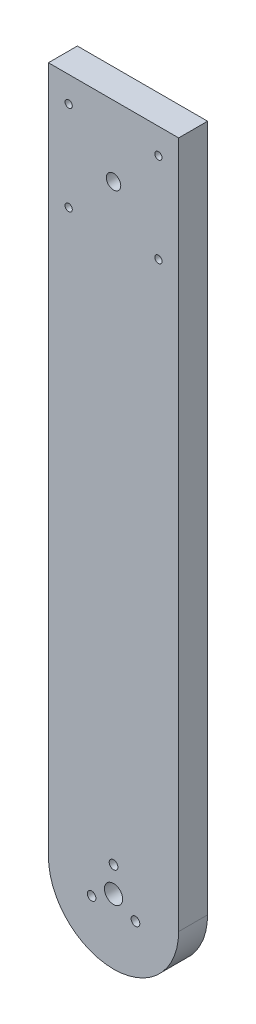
from build123d import *

# Parameters (mm, degrees)
SKETCH1_R           = 1.25
SKETCH1_R_2         = 2.5
SKETCH1_R_3         = 1.5
SKETCH1_R_4         = 3.15
BOSS_EXTRUDE1_DEPTH = 10


with BuildPart() as part:
    # Sketch1 → Boss-Extrude1 (new body)
    with BuildSketch(Plane.XY):
        with BuildLine():
            Line((-22.5, 130), (22.5, 130))
            Line((22.5, 130), (22.5, -107.5))
            ThreePointArc((22.5, -107.5), (0, -130), (-22.5, -107.5))
            Line((-22.5, -107.5), (-22.5, 130))
        make_face()
        with Locations((-15.5, 121.163920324)):
            Circle(SKETCH1_R, mode=Mode.SUBTRACT)
        with Locations(Location((15.5, 121.163920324, 0), (0, 0, 180))):
            Circle(SKETCH1_R, mode=Mode.SUBTRACT)
        with Locations((15.5, 90.163920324)):
            Circle(SKETCH1_R, mode=Mode.SUBTRACT)
        with Locations(Location((-15.5, 90.163920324, 0), (0, 0, 180))):
            Circle(SKETCH1_R, mode=Mode.SUBTRACT)
        with Locations((0, 105.663920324)):
            Circle(SKETCH1_R_2, mode=Mode.SUBTRACT)
        with Locations((0, -98.75)):
            Circle(SKETCH1_R_3, mode=Mode.SUBTRACT)
        with Locations((7.577722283, -111.875)):
            Circle(SKETCH1_R_3, mode=Mode.SUBTRACT)
        with Locations((-7.577722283, -111.875)):
            Circle(SKETCH1_R_3, mode=Mode.SUBTRACT)
        with Locations((0, -107.5)):
            Circle(SKETCH1_R_4, mode=Mode.SUBTRACT)
    extrude(amount=BOSS_EXTRUDE1_DEPTH)


solid = part.part
